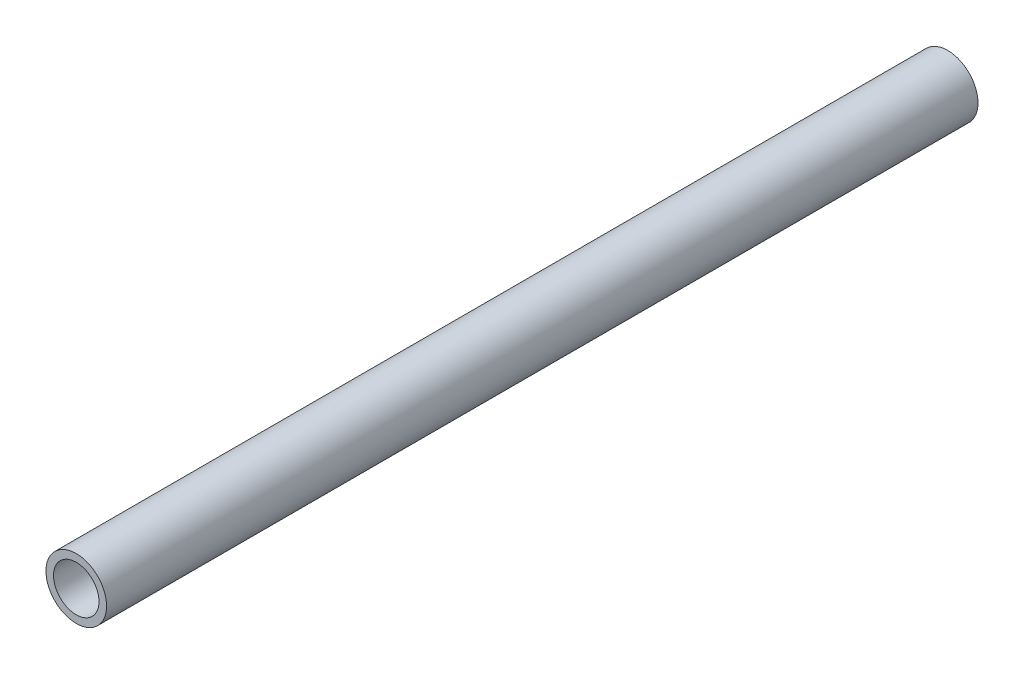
ISO-10303-21;
HEADER;
FILE_DESCRIPTION(('STEP AP214'),'2;1');
FILE_NAME('part.step','',(''),(''),'','','');
FILE_SCHEMA(('AUTOMOTIVE_DESIGN { 1 0 10303 214 1 1 1 1 }'));
ENDSEC;
DATA;
#1=APPLICATION_CONTEXT('core data for automotive mechanical design processes');
#2=APPLICATION_PROTOCOL_DEFINITION('international standard','automotive_design',2000,#1);
#3=PRODUCT_CONTEXT('',#1,'mechanical');
#4=PRODUCT('Part','Part','',(#3));
#5=PRODUCT_RELATED_PRODUCT_CATEGORY('part','',(#4));
#6=PRODUCT_DEFINITION_FORMATION('','',#4);
#7=PRODUCT_DEFINITION_CONTEXT('part definition',#1,'design');
#8=PRODUCT_DEFINITION('design','',#6,#7);
#9=PRODUCT_DEFINITION_SHAPE('','',#8);
#10=(LENGTH_UNIT() NAMED_UNIT(*) SI_UNIT(.MILLI.,.METRE.));
#11=(NAMED_UNIT(*) PLANE_ANGLE_UNIT() SI_UNIT($,.RADIAN.));
#12=(NAMED_UNIT(*) SI_UNIT($,.STERADIAN.) SOLID_ANGLE_UNIT());
#13=UNCERTAINTY_MEASURE_WITH_UNIT(LENGTH_MEASURE(1.E-05),#10,'distance_accuracy_value','');
#14=(GEOMETRIC_REPRESENTATION_CONTEXT(3) GLOBAL_UNCERTAINTY_ASSIGNED_CONTEXT((#13)) GLOBAL_UNIT_ASSIGNED_CONTEXT((#10,
#11,#12)) REPRESENTATION_CONTEXT('',''));
#15=CARTESIAN_POINT('',(0.,0.,0.));
#16=DIRECTION('',(0.,0.,1.));
#17=DIRECTION('',(1.,0.,0.));
#18=AXIS2_PLACEMENT_3D('',#15,#16,#17);
#19=CARTESIAN_POINT('',(0.,0.,115.));
#20=DIRECTION('',(0.,0.,1.));
#21=DIRECTION('',(1.,0.,0.));
#22=AXIS2_PLACEMENT_3D('',#19,#20,#21);
#23=PLANE('',#22);
#24=CARTESIAN_POINT('',(0.,0.,115.));
#25=DIRECTION('',(0.,0.,1.));
#26=DIRECTION('',(1.,0.,0.));
#27=AXIS2_PLACEMENT_3D('',#24,#25,#26);
#28=CIRCLE('',#27,4.);
#29=CARTESIAN_POINT('',(4.,0.,115.));
#30=VERTEX_POINT('',#29);
#31=EDGE_CURVE('E10',#30,#30,#28,.T.);
#32=ORIENTED_EDGE('',*,*,#31,.T.);
#33=EDGE_LOOP('',(#32));
#34=FACE_BOUND('',#33,.T.);
#35=CARTESIAN_POINT('',(0.,0.,115.));
#36=DIRECTION('',(0.,0.,1.));
#37=DIRECTION('',(1.,0.,0.));
#38=AXIS2_PLACEMENT_3D('',#35,#36,#37);
#39=CIRCLE('',#38,3.);
#40=CARTESIAN_POINT('',(3.,0.,115.));
#41=VERTEX_POINT('',#40);
#42=EDGE_CURVE('E45',#41,#41,#39,.T.);
#43=ORIENTED_EDGE('',*,*,#42,.F.);
#44=EDGE_LOOP('',(#43));
#45=FACE_BOUND('',#44,.T.);
#46=ADVANCED_FACE('F34',(#34,#45),#23,.T.);
#47=CARTESIAN_POINT('',(0.,0.,0.));
#48=DIRECTION('',(0.,0.,1.));
#49=DIRECTION('',(1.,0.,0.));
#50=AXIS2_PLACEMENT_3D('',#47,#48,#49);
#51=PLANE('',#50);
#52=CARTESIAN_POINT('',(0.,0.,0.));
#53=DIRECTION('',(0.,0.,1.));
#54=DIRECTION('',(1.,0.,0.));
#55=AXIS2_PLACEMENT_3D('',#52,#53,#54);
#56=CIRCLE('',#55,4.);
#57=CARTESIAN_POINT('',(4.,0.,0.));
#58=VERTEX_POINT('',#57);
#59=EDGE_CURVE('E38',#58,#58,#56,.T.);
#60=ORIENTED_EDGE('',*,*,#59,.F.);
#61=EDGE_LOOP('',(#60));
#62=FACE_BOUND('',#61,.T.);
#63=CARTESIAN_POINT('',(0.,0.,0.));
#64=DIRECTION('',(0.,0.,1.));
#65=DIRECTION('',(1.,0.,0.));
#66=AXIS2_PLACEMENT_3D('',#63,#64,#65);
#67=CIRCLE('',#66,3.);
#68=CARTESIAN_POINT('',(3.,0.,0.));
#69=VERTEX_POINT('',#68);
#70=EDGE_CURVE('E47',#69,#69,#67,.T.);
#71=ORIENTED_EDGE('',*,*,#70,.T.);
#72=EDGE_LOOP('',(#71));
#73=FACE_BOUND('',#72,.T.);
#74=ADVANCED_FACE('F57',(#62,#73),#51,.F.);
#75=CARTESIAN_POINT('',(0.,0.,115.));
#76=DIRECTION('',(0.,0.,-1.));
#77=DIRECTION('',(-1.,0.,0.));
#78=AXIS2_PLACEMENT_3D('',#75,#76,#77);
#79=CYLINDRICAL_SURFACE('',#78,4.);
#80=ORIENTED_EDGE('',*,*,#31,.F.);
#81=EDGE_LOOP('',(#80));
#82=FACE_BOUND('',#81,.T.);
#83=ORIENTED_EDGE('',*,*,#59,.T.);
#84=EDGE_LOOP('',(#83));
#85=FACE_BOUND('',#84,.T.);
#86=ADVANCED_FACE('F36',(#82,#85),#79,.T.);
#87=CARTESIAN_POINT('',(0.,0.,115.));
#88=DIRECTION('',(0.,0.,-1.));
#89=DIRECTION('',(-1.,0.,0.));
#90=AXIS2_PLACEMENT_3D('',#87,#88,#89);
#91=CYLINDRICAL_SURFACE('',#90,3.);
#92=ORIENTED_EDGE('',*,*,#42,.T.);
#93=EDGE_LOOP('',(#92));
#94=FACE_BOUND('',#93,.T.);
#95=ORIENTED_EDGE('',*,*,#70,.F.);
#96=EDGE_LOOP('',(#95));
#97=FACE_BOUND('',#96,.T.);
#98=ADVANCED_FACE('F53',(#94,#97),#91,.F.);
#99=CLOSED_SHELL('',(#46,#74,#86,#98));
#100=MANIFOLD_SOLID_BREP('B2',#99);
#101=ADVANCED_BREP_SHAPE_REPRESENTATION('',(#18,#100),#14);
#102=SHAPE_DEFINITION_REPRESENTATION(#9,#101);
ENDSEC;
END-ISO-10303-21;
